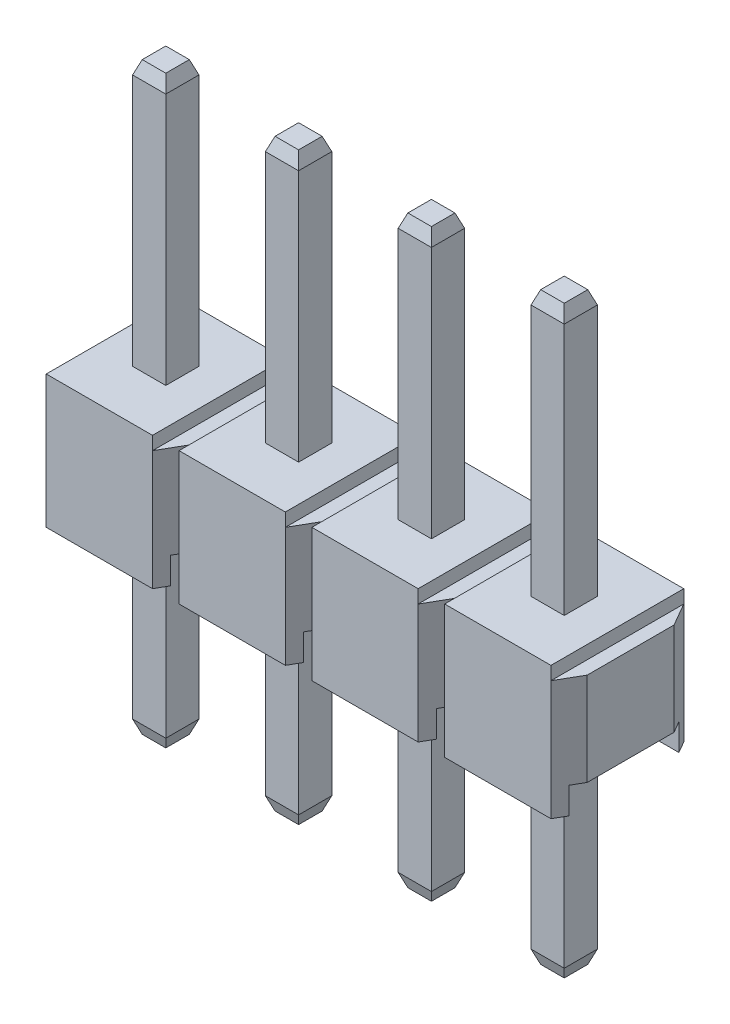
from build123d import *
from OCP.BRepFilletAPI import BRepFilletAPI_MakeChamfer

# Parameters (mm, degrees)
EXTRUDE_2_DEPTH                     = 2
SKETCH_3_W                          = 1.653589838
SKETCH_3_H                          = 0.4
CUT_EXTRUDE_1_DEPTH                 = 1
SKETCH_4_W                          = 0.2
SKETCH_4_H                          = 0.2
CUT_EXTRUDE_2_DEPTH                 = 3.449489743
EXTRUDE_START                       = -2.8
SKETCH_1_W                          = 0.5
SKETCH_1_H                          = 0.5
EXTRUDE_1_DEPTH                     = 8.8
CHAMFER_1_SIZE                      = 0.2
CHAMFER_1_SIZE2                     = 0.072794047
CHAMFER_2_SIZE                      = 0.2
CHAMFER_2_SIZE2                     = 0.072794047
PATTERN_LINEAR_1_COUNT              = 4
PATTERN_LINEAR_1_PITCH              = 2
PATTERN_LINEAR_2_COUNT              = 100
PATTERN_LINEAR_2_PITCH              = 2
CHAMFER_1_OF_PATTERN_LINEAR_2_SIZE  = 0.2
CHAMFER_1_OF_PATTERN_LINEAR_2_SIZE2 = 0.072794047
CHAMFER_2_OF_PATTERN_LINEAR_2_SIZE  = 0.2
CHAMFER_2_OF_PATTERN_LINEAR_2_SIZE2 = 0.072794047


with BuildPart() as part:
    # Sketch 2 → Extrude 2 (new body)
    with BuildSketch(Plane(origin=(0, 0, 0), x_dir=(1, 0, 0), z_dir=(0, 1, 0))):
        Polygon((-1, 0.653589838), (-0.8, 1), (0.8, 1), (1, 0.653589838), (1, -0.653589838), (0.8, -1), (-0.8, -1), (-1, -0.653589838), align=None)
    extrude_2 = extrude(amount=EXTRUDE_2_DEPTH)

    # Sketch 3 → Cut-Extrude 1 (cut, symmetric)
    with BuildSketch(Plane(origin=(0, 0, 0), x_dir=(0, 0, -1), z_dir=(1, 0, 0))):
        with Locations((0, 0.2)):
            Rectangle(SKETCH_3_W, SKETCH_3_H)
    cut_extrude_1 = extrude(amount=CUT_EXTRUDE_1_DEPTH, both=True, mode=Mode.SUBTRACT)

    # Sketch 4 → Cut-Extrude 2 (cut, symmetric)
    with BuildSketch(Plane.XY):
        with Locations((-0.9, 1.9)):
            Rectangle(SKETCH_4_W, SKETCH_4_H)
        with Locations((0.9, 1.9)):
            Rectangle(SKETCH_4_W, SKETCH_4_H)
    cut_extrude_2 = extrude(amount=CUT_EXTRUDE_2_DEPTH, both=True, mode=Mode.SUBTRACT)

    # Sketch 1 → Extrude 1 (add)
    with BuildSketch(Plane(origin=(0, 0, 0), x_dir=(1, 0, 0), z_dir=(0, 1, 0)).offset(EXTRUDE_START)):
        Rectangle(SKETCH_1_W, SKETCH_1_H)
    extrude_1 = extrude(amount=EXTRUDE_1_DEPTH)

    # Chamfer 1: one chamfer whose edges measure the first distance from different faces: ONE call of the kernel's chamfer builder (chamfer() names one face for all edges)
    chamfer_1_edges_1 = [part.edges().sort_by_distance(p)[0] for p in [
        (-0.25, 6, 0),
    ]]
    chamfer_1_side_1 = [part.faces().sort_by_distance(p)[0] for p in [
        (-0.25, 4, 0),
    ]]
    chamfer_1_edges_2 = [part.edges().sort_by_distance(p)[0] for p in [
        (0, 6, 0.25),
    ]]
    chamfer_1_side_2 = [part.faces().sort_by_distance(p)[0] for p in [
        (0, 4, 0.25),
    ]]
    chamfer_1_edges_3 = [part.edges().sort_by_distance(p)[0] for p in [
        (0.25, 6, 0),
    ]]
    chamfer_1_side_3 = [part.faces().sort_by_distance(p)[0] for p in [
        (0.25, 4, 0),
    ]]
    chamfer_1_edges_4 = [part.edges().sort_by_distance(p)[0] for p in [
        (0, 6, -0.25),
    ]]
    chamfer_1_side_4 = [part.faces().sort_by_distance(p)[0] for p in [
        (0, 4, -0.25),
    ]]
    chamfer_1 = BRepFilletAPI_MakeChamfer(part.part.solid().wrapped)
    for e in chamfer_1_edges_1:
        chamfer_1.Add(CHAMFER_1_SIZE, CHAMFER_1_SIZE2, e.wrapped, chamfer_1_side_1[0].wrapped)  # the first distance lies on this face
    for e in chamfer_1_edges_2:
        chamfer_1.Add(CHAMFER_1_SIZE, CHAMFER_1_SIZE2, e.wrapped, chamfer_1_side_2[0].wrapped)  # the first distance lies on this face
    for e in chamfer_1_edges_3:
        chamfer_1.Add(CHAMFER_1_SIZE, CHAMFER_1_SIZE2, e.wrapped, chamfer_1_side_3[0].wrapped)  # the first distance lies on this face
    for e in chamfer_1_edges_4:
        chamfer_1.Add(CHAMFER_1_SIZE, CHAMFER_1_SIZE2, e.wrapped, chamfer_1_side_4[0].wrapped)  # the first distance lies on this face
    add(Compound.cast(chamfer_1.Shape()), mode=Mode.REPLACE)

    # Chamfer 2: one chamfer whose edges measure the first distance from different faces: ONE call of the kernel's chamfer builder (chamfer() names one face for all edges)
    chamfer_2_edges_1 = [part.edges().sort_by_distance(p)[0] for p in [
        (-0.25, -2.8, 0),
    ]]
    chamfer_2_side_1 = [part.faces().sort_by_distance(p)[0] for p in [
        (-0.25, -1.2, 0),
    ]]
    chamfer_2_edges_2 = [part.edges().sort_by_distance(p)[0] for p in [
        (0, -2.8, 0.25),
    ]]
    chamfer_2_side_2 = [part.faces().sort_by_distance(p)[0] for p in [
        (0, -1.2, 0.25),
    ]]
    chamfer_2_edges_3 = [part.edges().sort_by_distance(p)[0] for p in [
        (0.25, -2.8, 0),
    ]]
    chamfer_2_side_3 = [part.faces().sort_by_distance(p)[0] for p in [
        (0.25, -1.2, 0),
    ]]
    chamfer_2_edges_4 = [part.edges().sort_by_distance(p)[0] for p in [
        (0, -2.8, -0.25),
    ]]
    chamfer_2_side_4 = [part.faces().sort_by_distance(p)[0] for p in [
        (0, -1.2, -0.25),
    ]]
    chamfer_2 = BRepFilletAPI_MakeChamfer(part.part.solid().wrapped)
    for e in chamfer_2_edges_1:
        chamfer_2.Add(CHAMFER_2_SIZE, CHAMFER_2_SIZE2, e.wrapped, chamfer_2_side_1[0].wrapped)  # the first distance lies on this face
    for e in chamfer_2_edges_2:
        chamfer_2.Add(CHAMFER_2_SIZE, CHAMFER_2_SIZE2, e.wrapped, chamfer_2_side_2[0].wrapped)  # the first distance lies on this face
    for e in chamfer_2_edges_3:
        chamfer_2.Add(CHAMFER_2_SIZE, CHAMFER_2_SIZE2, e.wrapped, chamfer_2_side_3[0].wrapped)  # the first distance lies on this face
    for e in chamfer_2_edges_4:
        chamfer_2.Add(CHAMFER_2_SIZE, CHAMFER_2_SIZE2, e.wrapped, chamfer_2_side_4[0].wrapped)  # the first distance lies on this face
    add(Compound.cast(chamfer_2.Shape()), mode=Mode.REPLACE)

    # Pattern Linear 1: Extrude 2, Cut-Extrude 1, Cut-Extrude 2 ×4
    with Locations(*[(-i * PATTERN_LINEAR_1_PITCH, 0, 0) for i in range(1, PATTERN_LINEAR_1_COUNT)]):
        add(extrude_2)
        add(cut_extrude_1, mode=Mode.SUBTRACT)
        add(cut_extrude_2, mode=Mode.SUBTRACT)

    # Pattern Linear 2: Extrude 1 ×100, 96 skipped
    with Locations(*[(-i * PATTERN_LINEAR_2_PITCH, 0, 0) for i in range(1, PATTERN_LINEAR_2_COUNT) if i not in (4, 5, 6, 7, 8, 9, 10, 11, 12, 13, 14, 15, 16, 17, 18, 19, 20, 21, 22, 23, 24, 25, 26, 27, 28, 29, 30, 31, 32, 33, 34, 35, 36, 37, 38, 39, 40, 41, 42, 43, 44, 45, 46, 47, 48, 49, 50, 51, 52, 53, 54, 55, 56, 57, 58, 59, 60, 61, 62, 63, 64, 65, 66, 67, 68, 69, 70, 71, 72, 73, 74, 75, 76, 77, 78, 79, 80, 81, 82, 83, 84, 85, 86, 87, 88, 89, 90, 91, 92, 93, 94, 95, 96, 97, 98, 99)]):
        add(extrude_1)

    # Chamfer 1 of Pattern Linear 2: one chamfer whose edges measure the first distance from different faces: ONE call of the kernel's chamfer builder (chamfer() names one face for all edges)
    chamfer_1_of_pattern_linear_2_edges_1 = [part.edges().sort_by_distance(p)[0] for p in [
        (-2.25, 6, 0),
    ]]
    chamfer_1_of_pattern_linear_2_side_1 = [part.faces().sort_by_distance(p)[0] for p in [
        (-2.25, 4, 0),
    ]]
    chamfer_1_of_pattern_linear_2_edges_2 = [part.edges().sort_by_distance(p)[0] for p in [
        (-2, 6, 0.25),
    ]]
    chamfer_1_of_pattern_linear_2_side_2 = [part.faces().sort_by_distance(p)[0] for p in [
        (-2, 4, 0.25),
    ]]
    chamfer_1_of_pattern_linear_2_edges_3 = [part.edges().sort_by_distance(p)[0] for p in [
        (-1.75, 6, 0),
    ]]
    chamfer_1_of_pattern_linear_2_side_3 = [part.faces().sort_by_distance(p)[0] for p in [
        (-1.75, 4, 0),
    ]]
    chamfer_1_of_pattern_linear_2_edges_4 = [part.edges().sort_by_distance(p)[0] for p in [
        (-2, 6, -0.25),
    ]]
    chamfer_1_of_pattern_linear_2_side_4 = [part.faces().sort_by_distance(p)[0] for p in [
        (-2, 4, -0.25),
    ]]
    chamfer_1_of_pattern_linear_2_edges_5 = [part.edges().sort_by_distance(p)[0] for p in [
        (-4.25, 6, 0),
    ]]
    chamfer_1_of_pattern_linear_2_side_5 = [part.faces().sort_by_distance(p)[0] for p in [
        (-4.25, 4, 0),
    ]]
    chamfer_1_of_pattern_linear_2_edges_6 = [part.edges().sort_by_distance(p)[0] for p in [
        (-4, 6, 0.25),
    ]]
    chamfer_1_of_pattern_linear_2_side_6 = [part.faces().sort_by_distance(p)[0] for p in [
        (-4, 4, 0.25),
    ]]
    chamfer_1_of_pattern_linear_2_edges_7 = [part.edges().sort_by_distance(p)[0] for p in [
        (-3.75, 6, 0),
    ]]
    chamfer_1_of_pattern_linear_2_side_7 = [part.faces().sort_by_distance(p)[0] for p in [
        (-3.75, 4, 0),
    ]]
    chamfer_1_of_pattern_linear_2_edges_8 = [part.edges().sort_by_distance(p)[0] for p in [
        (-4, 6, -0.25),
    ]]
    chamfer_1_of_pattern_linear_2_side_8 = [part.faces().sort_by_distance(p)[0] for p in [
        (-4, 4, -0.25),
    ]]
    chamfer_1_of_pattern_linear_2_edges_9 = [part.edges().sort_by_distance(p)[0] for p in [
        (-6.25, 6, 0),
    ]]
    chamfer_1_of_pattern_linear_2_side_9 = [part.faces().sort_by_distance(p)[0] for p in [
        (-6.25, 4, 0),
    ]]
    chamfer_1_of_pattern_linear_2_edges_10 = [part.edges().sort_by_distance(p)[0] for p in [
        (-6, 6, 0.25),
    ]]
    chamfer_1_of_pattern_linear_2_side_10 = [part.faces().sort_by_distance(p)[0] for p in [
        (-6, 4, 0.25),
    ]]
    chamfer_1_of_pattern_linear_2_edges_11 = [part.edges().sort_by_distance(p)[0] for p in [
        (-5.75, 6, 0),
    ]]
    chamfer_1_of_pattern_linear_2_side_11 = [part.faces().sort_by_distance(p)[0] for p in [
        (-5.75, 4, 0),
    ]]
    chamfer_1_of_pattern_linear_2_edges_12 = [part.edges().sort_by_distance(p)[0] for p in [
        (-6, 6, -0.25),
    ]]
    chamfer_1_of_pattern_linear_2_side_12 = [part.faces().sort_by_distance(p)[0] for p in [
        (-6, 4, -0.25),
    ]]
    chamfer_1_of_pattern_linear_2 = BRepFilletAPI_MakeChamfer(part.part.solid().wrapped)
    for e in chamfer_1_of_pattern_linear_2_edges_1:
        chamfer_1_of_pattern_linear_2.Add(CHAMFER_1_OF_PATTERN_LINEAR_2_SIZE, CHAMFER_1_OF_PATTERN_LINEAR_2_SIZE2, e.wrapped, chamfer_1_of_pattern_linear_2_side_1[0].wrapped)  # the first distance lies on this face
    for e in chamfer_1_of_pattern_linear_2_edges_2:
        chamfer_1_of_pattern_linear_2.Add(CHAMFER_1_OF_PATTERN_LINEAR_2_SIZE, CHAMFER_1_OF_PATTERN_LINEAR_2_SIZE2, e.wrapped, chamfer_1_of_pattern_linear_2_side_2[0].wrapped)  # the first distance lies on this face
    for e in chamfer_1_of_pattern_linear_2_edges_3:
        chamfer_1_of_pattern_linear_2.Add(CHAMFER_1_OF_PATTERN_LINEAR_2_SIZE, CHAMFER_1_OF_PATTERN_LINEAR_2_SIZE2, e.wrapped, chamfer_1_of_pattern_linear_2_side_3[0].wrapped)  # the first distance lies on this face
    for e in chamfer_1_of_pattern_linear_2_edges_4:
        chamfer_1_of_pattern_linear_2.Add(CHAMFER_1_OF_PATTERN_LINEAR_2_SIZE, CHAMFER_1_OF_PATTERN_LINEAR_2_SIZE2, e.wrapped, chamfer_1_of_pattern_linear_2_side_4[0].wrapped)  # the first distance lies on this face
    for e in chamfer_1_of_pattern_linear_2_edges_5:
        chamfer_1_of_pattern_linear_2.Add(CHAMFER_1_OF_PATTERN_LINEAR_2_SIZE, CHAMFER_1_OF_PATTERN_LINEAR_2_SIZE2, e.wrapped, chamfer_1_of_pattern_linear_2_side_5[0].wrapped)  # the first distance lies on this face
    for e in chamfer_1_of_pattern_linear_2_edges_6:
        chamfer_1_of_pattern_linear_2.Add(CHAMFER_1_OF_PATTERN_LINEAR_2_SIZE, CHAMFER_1_OF_PATTERN_LINEAR_2_SIZE2, e.wrapped, chamfer_1_of_pattern_linear_2_side_6[0].wrapped)  # the first distance lies on this face
    for e in chamfer_1_of_pattern_linear_2_edges_7:
        chamfer_1_of_pattern_linear_2.Add(CHAMFER_1_OF_PATTERN_LINEAR_2_SIZE, CHAMFER_1_OF_PATTERN_LINEAR_2_SIZE2, e.wrapped, chamfer_1_of_pattern_linear_2_side_7[0].wrapped)  # the first distance lies on this face
    for e in chamfer_1_of_pattern_linear_2_edges_8:
        chamfer_1_of_pattern_linear_2.Add(CHAMFER_1_OF_PATTERN_LINEAR_2_SIZE, CHAMFER_1_OF_PATTERN_LINEAR_2_SIZE2, e.wrapped, chamfer_1_of_pattern_linear_2_side_8[0].wrapped)  # the first distance lies on this face
    for e in chamfer_1_of_pattern_linear_2_edges_9:
        chamfer_1_of_pattern_linear_2.Add(CHAMFER_1_OF_PATTERN_LINEAR_2_SIZE, CHAMFER_1_OF_PATTERN_LINEAR_2_SIZE2, e.wrapped, chamfer_1_of_pattern_linear_2_side_9[0].wrapped)  # the first distance lies on this face
    for e in chamfer_1_of_pattern_linear_2_edges_10:
        chamfer_1_of_pattern_linear_2.Add(CHAMFER_1_OF_PATTERN_LINEAR_2_SIZE, CHAMFER_1_OF_PATTERN_LINEAR_2_SIZE2, e.wrapped, chamfer_1_of_pattern_linear_2_side_10[0].wrapped)  # the first distance lies on this face
    for e in chamfer_1_of_pattern_linear_2_edges_11:
        chamfer_1_of_pattern_linear_2.Add(CHAMFER_1_OF_PATTERN_LINEAR_2_SIZE, CHAMFER_1_OF_PATTERN_LINEAR_2_SIZE2, e.wrapped, chamfer_1_of_pattern_linear_2_side_11[0].wrapped)  # the first distance lies on this face
    for e in chamfer_1_of_pattern_linear_2_edges_12:
        chamfer_1_of_pattern_linear_2.Add(CHAMFER_1_OF_PATTERN_LINEAR_2_SIZE, CHAMFER_1_OF_PATTERN_LINEAR_2_SIZE2, e.wrapped, chamfer_1_of_pattern_linear_2_side_12[0].wrapped)  # the first distance lies on this face
    add(Compound.cast(chamfer_1_of_pattern_linear_2.Shape()), mode=Mode.REPLACE)

    # Chamfer 2 of Pattern Linear 2: one chamfer whose edges measure the first distance from different faces: ONE call of the kernel's chamfer builder (chamfer() names one face for all edges)
    chamfer_2_of_pattern_linear_2_edges_1 = [part.edges().sort_by_distance(p)[0] for p in [
        (-2.25, -2.8, 0),
    ]]
    chamfer_2_of_pattern_linear_2_side_1 = [part.faces().sort_by_distance(p)[0] for p in [
        (-2.25, -1.2, 0),
    ]]
    chamfer_2_of_pattern_linear_2_edges_2 = [part.edges().sort_by_distance(p)[0] for p in [
        (-2, -2.8, 0.25),
    ]]
    chamfer_2_of_pattern_linear_2_side_2 = [part.faces().sort_by_distance(p)[0] for p in [
        (-2, -1.2, 0.25),
    ]]
    chamfer_2_of_pattern_linear_2_edges_3 = [part.edges().sort_by_distance(p)[0] for p in [
        (-1.75, -2.8, 0),
    ]]
    chamfer_2_of_pattern_linear_2_side_3 = [part.faces().sort_by_distance(p)[0] for p in [
        (-1.75, -1.2, 0),
    ]]
    chamfer_2_of_pattern_linear_2_edges_4 = [part.edges().sort_by_distance(p)[0] for p in [
        (-2, -2.8, -0.25),
    ]]
    chamfer_2_of_pattern_linear_2_side_4 = [part.faces().sort_by_distance(p)[0] for p in [
        (-2, -1.2, -0.25),
    ]]
    chamfer_2_of_pattern_linear_2_edges_5 = [part.edges().sort_by_distance(p)[0] for p in [
        (-4.25, -2.8, 0),
    ]]
    chamfer_2_of_pattern_linear_2_side_5 = [part.faces().sort_by_distance(p)[0] for p in [
        (-4.25, -1.2, 0),
    ]]
    chamfer_2_of_pattern_linear_2_edges_6 = [part.edges().sort_by_distance(p)[0] for p in [
        (-4, -2.8, 0.25),
    ]]
    chamfer_2_of_pattern_linear_2_side_6 = [part.faces().sort_by_distance(p)[0] for p in [
        (-4, -1.2, 0.25),
    ]]
    chamfer_2_of_pattern_linear_2_edges_7 = [part.edges().sort_by_distance(p)[0] for p in [
        (-3.75, -2.8, 0),
    ]]
    chamfer_2_of_pattern_linear_2_side_7 = [part.faces().sort_by_distance(p)[0] for p in [
        (-3.75, -1.2, 0),
    ]]
    chamfer_2_of_pattern_linear_2_edges_8 = [part.edges().sort_by_distance(p)[0] for p in [
        (-4, -2.8, -0.25),
    ]]
    chamfer_2_of_pattern_linear_2_side_8 = [part.faces().sort_by_distance(p)[0] for p in [
        (-4, -1.2, -0.25),
    ]]
    chamfer_2_of_pattern_linear_2_edges_9 = [part.edges().sort_by_distance(p)[0] for p in [
        (-6.25, -2.8, 0),
    ]]
    chamfer_2_of_pattern_linear_2_side_9 = [part.faces().sort_by_distance(p)[0] for p in [
        (-6.25, -1.2, 0),
    ]]
    chamfer_2_of_pattern_linear_2_edges_10 = [part.edges().sort_by_distance(p)[0] for p in [
        (-6, -2.8, 0.25),
    ]]
    chamfer_2_of_pattern_linear_2_side_10 = [part.faces().sort_by_distance(p)[0] for p in [
        (-6, -1.2, 0.25),
    ]]
    chamfer_2_of_pattern_linear_2_edges_11 = [part.edges().sort_by_distance(p)[0] for p in [
        (-5.75, -2.8, 0),
    ]]
    chamfer_2_of_pattern_linear_2_side_11 = [part.faces().sort_by_distance(p)[0] for p in [
        (-5.75, -1.2, 0),
    ]]
    chamfer_2_of_pattern_linear_2_edges_12 = [part.edges().sort_by_distance(p)[0] for p in [
        (-6, -2.8, -0.25),
    ]]
    chamfer_2_of_pattern_linear_2_side_12 = [part.faces().sort_by_distance(p)[0] for p in [
        (-6, -1.2, -0.25),
    ]]
    chamfer_2_of_pattern_linear_2 = BRepFilletAPI_MakeChamfer(part.part.solid().wrapped)
    for e in chamfer_2_of_pattern_linear_2_edges_1:
        chamfer_2_of_pattern_linear_2.Add(CHAMFER_2_OF_PATTERN_LINEAR_2_SIZE, CHAMFER_2_OF_PATTERN_LINEAR_2_SIZE2, e.wrapped, chamfer_2_of_pattern_linear_2_side_1[0].wrapped)  # the first distance lies on this face
    for e in chamfer_2_of_pattern_linear_2_edges_2:
        chamfer_2_of_pattern_linear_2.Add(CHAMFER_2_OF_PATTERN_LINEAR_2_SIZE, CHAMFER_2_OF_PATTERN_LINEAR_2_SIZE2, e.wrapped, chamfer_2_of_pattern_linear_2_side_2[0].wrapped)  # the first distance lies on this face
    for e in chamfer_2_of_pattern_linear_2_edges_3:
        chamfer_2_of_pattern_linear_2.Add(CHAMFER_2_OF_PATTERN_LINEAR_2_SIZE, CHAMFER_2_OF_PATTERN_LINEAR_2_SIZE2, e.wrapped, chamfer_2_of_pattern_linear_2_side_3[0].wrapped)  # the first distance lies on this face
    for e in chamfer_2_of_pattern_linear_2_edges_4:
        chamfer_2_of_pattern_linear_2.Add(CHAMFER_2_OF_PATTERN_LINEAR_2_SIZE, CHAMFER_2_OF_PATTERN_LINEAR_2_SIZE2, e.wrapped, chamfer_2_of_pattern_linear_2_side_4[0].wrapped)  # the first distance lies on this face
    for e in chamfer_2_of_pattern_linear_2_edges_5:
        chamfer_2_of_pattern_linear_2.Add(CHAMFER_2_OF_PATTERN_LINEAR_2_SIZE, CHAMFER_2_OF_PATTERN_LINEAR_2_SIZE2, e.wrapped, chamfer_2_of_pattern_linear_2_side_5[0].wrapped)  # the first distance lies on this face
    for e in chamfer_2_of_pattern_linear_2_edges_6:
        chamfer_2_of_pattern_linear_2.Add(CHAMFER_2_OF_PATTERN_LINEAR_2_SIZE, CHAMFER_2_OF_PATTERN_LINEAR_2_SIZE2, e.wrapped, chamfer_2_of_pattern_linear_2_side_6[0].wrapped)  # the first distance lies on this face
    for e in chamfer_2_of_pattern_linear_2_edges_7:
        chamfer_2_of_pattern_linear_2.Add(CHAMFER_2_OF_PATTERN_LINEAR_2_SIZE, CHAMFER_2_OF_PATTERN_LINEAR_2_SIZE2, e.wrapped, chamfer_2_of_pattern_linear_2_side_7[0].wrapped)  # the first distance lies on this face
    for e in chamfer_2_of_pattern_linear_2_edges_8:
        chamfer_2_of_pattern_linear_2.Add(CHAMFER_2_OF_PATTERN_LINEAR_2_SIZE, CHAMFER_2_OF_PATTERN_LINEAR_2_SIZE2, e.wrapped, chamfer_2_of_pattern_linear_2_side_8[0].wrapped)  # the first distance lies on this face
    for e in chamfer_2_of_pattern_linear_2_edges_9:
        chamfer_2_of_pattern_linear_2.Add(CHAMFER_2_OF_PATTERN_LINEAR_2_SIZE, CHAMFER_2_OF_PATTERN_LINEAR_2_SIZE2, e.wrapped, chamfer_2_of_pattern_linear_2_side_9[0].wrapped)  # the first distance lies on this face
    for e in chamfer_2_of_pattern_linear_2_edges_10:
        chamfer_2_of_pattern_linear_2.Add(CHAMFER_2_OF_PATTERN_LINEAR_2_SIZE, CHAMFER_2_OF_PATTERN_LINEAR_2_SIZE2, e.wrapped, chamfer_2_of_pattern_linear_2_side_10[0].wrapped)  # the first distance lies on this face
    for e in chamfer_2_of_pattern_linear_2_edges_11:
        chamfer_2_of_pattern_linear_2.Add(CHAMFER_2_OF_PATTERN_LINEAR_2_SIZE, CHAMFER_2_OF_PATTERN_LINEAR_2_SIZE2, e.wrapped, chamfer_2_of_pattern_linear_2_side_11[0].wrapped)  # the first distance lies on this face
    for e in chamfer_2_of_pattern_linear_2_edges_12:
        chamfer_2_of_pattern_linear_2.Add(CHAMFER_2_OF_PATTERN_LINEAR_2_SIZE, CHAMFER_2_OF_PATTERN_LINEAR_2_SIZE2, e.wrapped, chamfer_2_of_pattern_linear_2_side_12[0].wrapped)  # the first distance lies on this face
    add(Compound.cast(chamfer_2_of_pattern_linear_2.Shape()), mode=Mode.REPLACE)


solid = part.part
